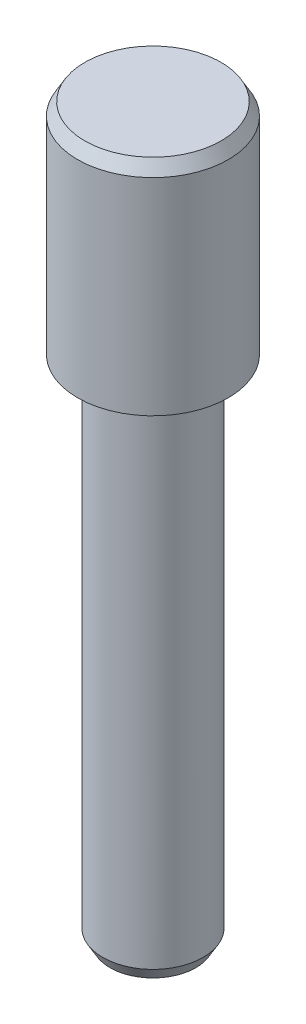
ISO-10303-21;
HEADER;
FILE_DESCRIPTION(('STEP AP214'),'2;1');
FILE_NAME('part.step','',(''),(''),'','','');
FILE_SCHEMA(('AUTOMOTIVE_DESIGN { 1 0 10303 214 1 1 1 1 }'));
ENDSEC;
DATA;
#1=APPLICATION_CONTEXT('core data for automotive mechanical design processes');
#2=APPLICATION_PROTOCOL_DEFINITION('international standard','automotive_design',2000,#1);
#3=PRODUCT_CONTEXT('',#1,'mechanical');
#4=PRODUCT('Part','Part','',(#3));
#5=PRODUCT_RELATED_PRODUCT_CATEGORY('part','',(#4));
#6=PRODUCT_DEFINITION_FORMATION('','',#4);
#7=PRODUCT_DEFINITION_CONTEXT('part definition',#1,'design');
#8=PRODUCT_DEFINITION('design','',#6,#7);
#9=PRODUCT_DEFINITION_SHAPE('','',#8);
#10=(LENGTH_UNIT() NAMED_UNIT(*) SI_UNIT(.MILLI.,.METRE.));
#11=(NAMED_UNIT(*) PLANE_ANGLE_UNIT() SI_UNIT($,.RADIAN.));
#12=(NAMED_UNIT(*) SI_UNIT($,.STERADIAN.) SOLID_ANGLE_UNIT());
#13=UNCERTAINTY_MEASURE_WITH_UNIT(LENGTH_MEASURE(1.E-05),#10,'distance_accuracy_value','');
#14=(GEOMETRIC_REPRESENTATION_CONTEXT(3) GLOBAL_UNCERTAINTY_ASSIGNED_CONTEXT((#13)) GLOBAL_UNIT_ASSIGNED_CONTEXT((#10,
#11,#12)) REPRESENTATION_CONTEXT('',''));
#15=CARTESIAN_POINT('',(0.,0.,0.));
#16=DIRECTION('',(0.,0.,1.));
#17=DIRECTION('',(1.,0.,0.));
#18=AXIS2_PLACEMENT_3D('',#15,#16,#17);
#19=CARTESIAN_POINT('',(0.,-9.,0.));
#20=DIRECTION('',(0.,1.,0.));
#21=DIRECTION('',(0.,0.,1.));
#22=AXIS2_PLACEMENT_3D('',#19,#20,#21);
#23=PLANE('',#22);
#24=CARTESIAN_POINT('',(0.,-9.,0.));
#25=DIRECTION('',(0.,1.,0.));
#26=DIRECTION('',(0.,0.,1.));
#27=AXIS2_PLACEMENT_3D('',#24,#25,#26);
#28=CIRCLE('',#27,2.5);
#29=CARTESIAN_POINT('',(0.,-9.,2.5));
#30=VERTEX_POINT('',#29);
#31=EDGE_CURVE('E54',#30,#30,#28,.F.);
#32=ORIENTED_EDGE('',*,*,#31,.T.);
#33=EDGE_LOOP('',(#32));
#34=FACE_BOUND('',#33,.T.);
#35=CARTESIAN_POINT('',(0.,-9.,0.));
#36=DIRECTION('',(0.,1.,0.));
#37=DIRECTION('',(0.,0.,1.));
#38=AXIS2_PLACEMENT_3D('',#35,#36,#37);
#39=CIRCLE('',#38,2.);
#40=CARTESIAN_POINT('',(0.,-9.,2.));
#41=VERTEX_POINT('',#40);
#42=EDGE_CURVE('E45',#41,#41,#39,.F.);
#43=ORIENTED_EDGE('',*,*,#42,.F.);
#44=EDGE_LOOP('',(#43));
#45=FACE_BOUND('',#44,.T.);
#46=ADVANCED_FACE('F34',(#34,#45),#23,.F.);
#47=CARTESIAN_POINT('',(0.,-9.,0.));
#48=DIRECTION('',(0.,1.,0.));
#49=DIRECTION('',(0.,0.,1.));
#50=AXIS2_PLACEMENT_3D('',#47,#48,#49);
#51=CYLINDRICAL_SURFACE('',#50,3.);
#52=CARTESIAN_POINT('',(0.,-8.71132486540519,0.));
#53=DIRECTION('',(0.,1.,0.));
#54=DIRECTION('',(0.,0.,1.));
#55=AXIS2_PLACEMENT_3D('',#52,#53,#54);
#56=CIRCLE('',#55,3.);
#57=CARTESIAN_POINT('',(0.,-8.71132486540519,3.));
#58=VERTEX_POINT('',#57);
#59=EDGE_CURVE('E57',#58,#58,#56,.T.);
#60=ORIENTED_EDGE('',*,*,#59,.T.);
#61=EDGE_LOOP('',(#60));
#62=FACE_BOUND('',#61,.T.);
#63=CARTESIAN_POINT('',(0.,-0.500000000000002,0.));
#64=DIRECTION('',(0.,1.,0.));
#65=DIRECTION('',(0.,0.,1.));
#66=AXIS2_PLACEMENT_3D('',#63,#64,#65);
#67=CIRCLE('',#66,3.);
#68=CARTESIAN_POINT('',(0.,-0.500000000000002,3.));
#69=VERTEX_POINT('',#68);
#70=EDGE_CURVE('E60',#69,#69,#67,.F.);
#71=ORIENTED_EDGE('',*,*,#70,.T.);
#72=EDGE_LOOP('',(#71));
#73=FACE_BOUND('',#72,.T.);
#74=ADVANCED_FACE('F64',(#62,#73),#51,.T.);
#75=CARTESIAN_POINT('',(0.,0.,0.));
#76=DIRECTION('',(0.,1.,0.));
#77=DIRECTION('',(0.,0.,1.));
#78=AXIS2_PLACEMENT_3D('',#75,#76,#77);
#79=PLANE('',#78);
#80=CARTESIAN_POINT('',(0.,0.,0.));
#81=DIRECTION('',(0.,1.,0.));
#82=DIRECTION('',(0.,0.,1.));
#83=AXIS2_PLACEMENT_3D('',#80,#81,#82);
#84=CIRCLE('',#83,2.71132486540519);
#85=CARTESIAN_POINT('',(0.,0.,2.71132486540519));
#86=VERTEX_POINT('',#85);
#87=EDGE_CURVE('E49',#86,#86,#84,.T.);
#88=ORIENTED_EDGE('',*,*,#87,.T.);
#89=EDGE_LOOP('',(#88));
#90=FACE_BOUND('',#89,.T.);
#91=ADVANCED_FACE('F73',(#90),#79,.T.);
#92=CARTESIAN_POINT('',(0.,-8.71132486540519,0.));
#93=DIRECTION('',(0.,1.,0.));
#94=DIRECTION('',(0.,0.,1.));
#95=AXIS2_PLACEMENT_3D('',#92,#93,#94);
#96=CONICAL_SURFACE('',#95,3.,1.0471975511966);
#97=ORIENTED_EDGE('',*,*,#31,.F.);
#98=EDGE_LOOP('',(#97));
#99=FACE_BOUND('',#98,.T.);
#100=ORIENTED_EDGE('',*,*,#59,.F.);
#101=EDGE_LOOP('',(#100));
#102=FACE_BOUND('',#101,.T.);
#103=ADVANCED_FACE('F70',(#99,#102),#96,.T.);
#104=CARTESIAN_POINT('',(0.,0.,0.));
#105=DIRECTION('',(0.,-1.,0.));
#106=DIRECTION('',(0.,0.,-1.));
#107=AXIS2_PLACEMENT_3D('',#104,#105,#106);
#108=CONICAL_SURFACE('',#107,2.71132486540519,0.523598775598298);
#109=ORIENTED_EDGE('',*,*,#70,.F.);
#110=EDGE_LOOP('',(#109));
#111=FACE_BOUND('',#110,.T.);
#112=ORIENTED_EDGE('',*,*,#87,.F.);
#113=EDGE_LOOP('',(#112));
#114=FACE_BOUND('',#113,.T.);
#115=ADVANCED_FACE('F66',(#111,#114),#108,.T.);
#116=CARTESIAN_POINT('',(0.,-29.,0.));
#117=DIRECTION('',(0.,1.,0.));
#118=DIRECTION('',(0.,0.,1.));
#119=AXIS2_PLACEMENT_3D('',#116,#117,#118);
#120=CYLINDRICAL_SURFACE('',#119,2.);
#121=CARTESIAN_POINT('',(0.,-28.5,0.));
#122=DIRECTION('',(0.,-1.,0.));
#123=DIRECTION('',(0.,0.,-1.));
#124=AXIS2_PLACEMENT_3D('',#121,#122,#123);
#125=CIRCLE('',#124,2.);
#126=CARTESIAN_POINT('',(0.,-28.5,-2.));
#127=VERTEX_POINT('',#126);
#128=EDGE_CURVE('E10',#127,#127,#125,.F.);
#129=ORIENTED_EDGE('',*,*,#128,.T.);
#130=EDGE_LOOP('',(#129));
#131=FACE_BOUND('',#130,.T.);
#132=ORIENTED_EDGE('',*,*,#42,.T.);
#133=EDGE_LOOP('',(#132));
#134=FACE_BOUND('',#133,.T.);
#135=ADVANCED_FACE('F69',(#131,#134),#120,.T.);
#136=CARTESIAN_POINT('',(0.,-29.,0.));
#137=DIRECTION('',(0.,-1.,0.));
#138=DIRECTION('',(0.,0.,-1.));
#139=AXIS2_PLACEMENT_3D('',#136,#137,#138);
#140=PLANE('',#139);
#141=CARTESIAN_POINT('',(0.,-29.,0.));
#142=DIRECTION('',(0.,-1.,0.));
#143=DIRECTION('',(0.,0.,-1.));
#144=AXIS2_PLACEMENT_3D('',#141,#142,#143);
#145=CIRCLE('',#144,1.71132486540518);
#146=CARTESIAN_POINT('',(0.,-29.,-1.71132486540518));
#147=VERTEX_POINT('',#146);
#148=EDGE_CURVE('E41',#147,#147,#145,.T.);
#149=ORIENTED_EDGE('',*,*,#148,.T.);
#150=EDGE_LOOP('',(#149));
#151=FACE_BOUND('',#150,.T.);
#152=ADVANCED_FACE('F93',(#151),#140,.T.);
#153=CARTESIAN_POINT('',(0.,-29.,0.));
#154=DIRECTION('',(0.,1.,0.));
#155=DIRECTION('',(0.,0.,1.));
#156=AXIS2_PLACEMENT_3D('',#153,#154,#155);
#157=CONICAL_SURFACE('',#156,1.71132486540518,0.523598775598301);
#158=ORIENTED_EDGE('',*,*,#128,.F.);
#159=EDGE_LOOP('',(#158));
#160=FACE_BOUND('',#159,.T.);
#161=ORIENTED_EDGE('',*,*,#148,.F.);
#162=EDGE_LOOP('',(#161));
#163=FACE_BOUND('',#162,.T.);
#164=ADVANCED_FACE('F36',(#160,#163),#157,.T.);
#165=CLOSED_SHELL('',(#46,#74,#91,#103,#115,#135,#152,#164));
#166=MANIFOLD_SOLID_BREP('B2',#165);
#167=ADVANCED_BREP_SHAPE_REPRESENTATION('',(#18,#166),#14);
#168=SHAPE_DEFINITION_REPRESENTATION(#9,#167);
ENDSEC;
END-ISO-10303-21;
